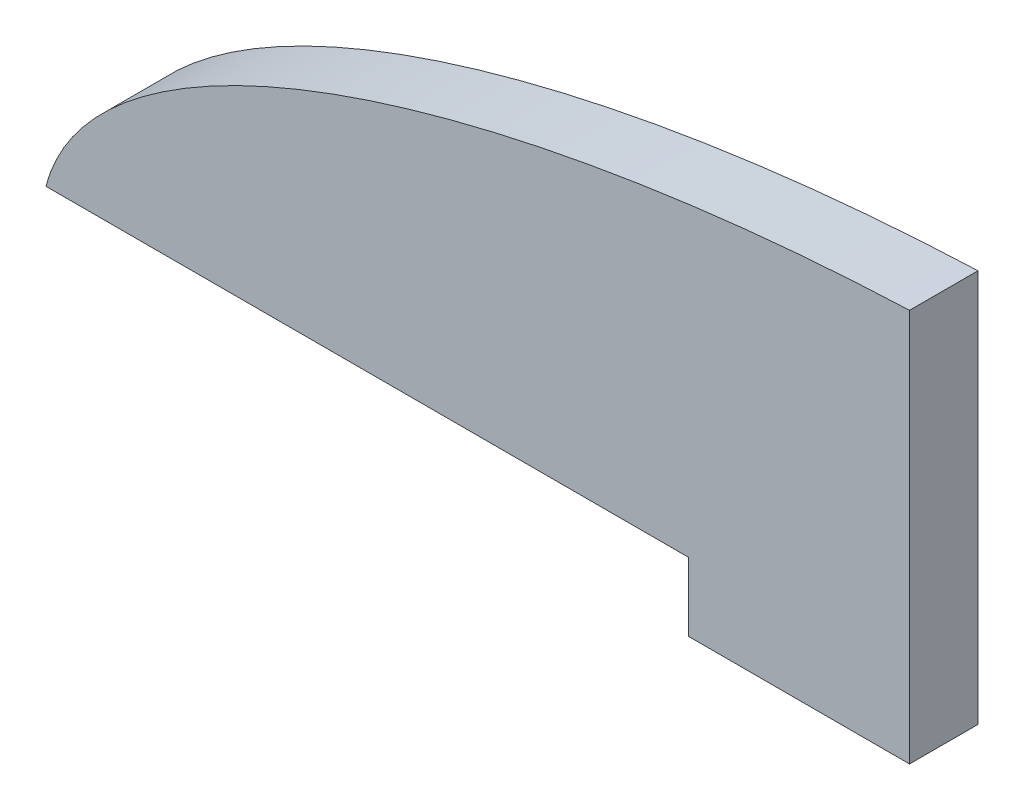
from build123d import *

# Parameters (mm, degrees)
BOSS_EXTRUDE1_DEPTH = 3.175


with BuildPart() as part:
    # Sketch1 → Boss-Extrude1 (new body)
    with BuildSketch(Plane.XY):
        with BuildLine():
            Line((-4.7625, 0), (-4.7625, 16.62861548))
            add(Edge.make_bspline(
                [(-4.7625, 16.62861548), (-41.307859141, 15.183208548), (-44.796770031, 1.5875)],
                knots=[4.818420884, 4.818420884, 4.818420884, 6.188110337, 6.188110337, 6.188110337], degree=2, weights=[1, 0.774517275, 1]))
            Line((-44.796770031, 1.5875), (-15, 1.5875))
            Line((-15, 1.5875), (-15, -1.5875))
            Line((-15, -1.5875), (-4.7625, -1.5875))
            Line((-4.7625, -1.5875), (-4.7625, 0))
        make_face()
    extrude(amount=BOSS_EXTRUDE1_DEPTH)


solid = part.part
